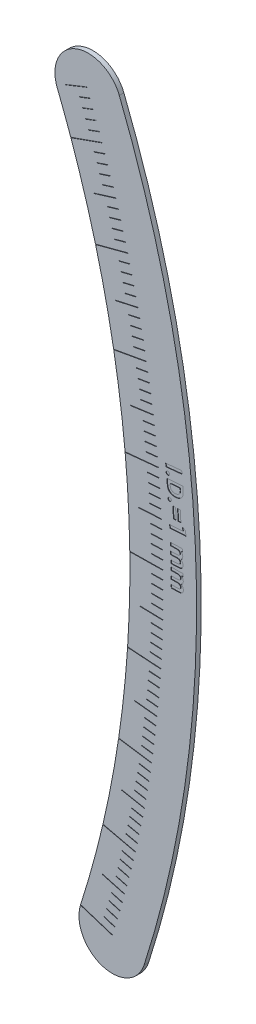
from build123d import *

# Parameters (mm, degrees)
EXTRUSION1_DEPTH             = 1
ENL_V_MAT_EXTRU_1_DEPTH      = 0.1
R_P_TITION_CIRCULAIRE1_COUNT = 86
R_P_TITION_CIRCULAIRE1_ANGLE = 39.5845
ENL_V_MAT_EXTRU_2_DEPTH      = 0.1
R_P_TITION_CIRCULAIRE2_COUNT = 9
R_P_TITION_CIRCULAIRE2_ANGLE = 37.256
ENL_V_MAT_EXTRU_3_DEPTH      = 0.1
R_P_TITION_CIRCULAIRE3_COUNT = 20
R_P_TITION_CIRCULAIRE3_ANGLE = 88.483
ENL_V_MAT_EXTRU_4_DEPTH      = 0.1


with BuildPart() as part:
    # Esquisse1 → Extrusion1 (new body)
    with BuildSketch(Plane.XY):
        with BuildLine():
            ThreePointArc((227.58368932, -72.98400068), (238.866520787, 7.986566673), (222.20038835, 88.022652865))
            ThreePointArc((222.20038835, 88.022652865), (212.789856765, 92.092897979), (208.71961165, 82.682366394))
            ThreePointArc((208.71961165, 82.682366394), (224.374618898, 7.502026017), (213.77631068, -68.556101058))
            ThreePointArc((213.77631068, -68.556101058), (218.466050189, -77.673740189), (227.58368932, -72.98400068))
        make_face()
    extrude(amount=EXTRUSION1_DEPTH)

    # Esquisse2 → Enl_v. mat.-Extru.1 (cut)
    with BuildSketch(Plane.XY.offset(1)):
        Polygon((220.695268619, -70.722439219), (220.664731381, -70.817662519), (218.284148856, -70.05423155), (218.314686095, -69.959008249), align=None)
    enl_v_mat_extru_1 = extrude(amount=-ENL_V_MAT_EXTRU_1_DEPTH, mode=Mode.SUBTRACT)

    # R_p_tition circulaire1: Enl_v. mat.-Extru.1 ×86 about axis
    r_p_tition_circulaire1_axis = Axis((0, 0, 0), (0, 0, 1))
    for i in range(1, R_P_TITION_CIRCULAIRE1_COUNT):
        add(enl_v_mat_extru_1.rotate(r_p_tition_circulaire1_axis, i * R_P_TITION_CIRCULAIRE1_ANGLE / (R_P_TITION_CIRCULAIRE1_COUNT - 1)), mode=Mode.SUBTRACT)

    # Esquisse3 → Enl_v. mat.-Extru.2 (cut)
    with BuildSketch(Plane.XY.offset(1)):
        Polygon((201.650608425, -64.614991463), (201.620071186, -64.710214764), (220.664731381, -70.817662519), (220.695268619, -70.722439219), align=None)
    enl_v_mat_extru_2 = extrude(amount=-ENL_V_MAT_EXTRU_2_DEPTH, mode=Mode.SUBTRACT)

    # R_p_tition circulaire2: Enl_v. mat.-Extru.2 ×9 about axis
    r_p_tition_circulaire2_axis = Axis((0, 0, 1), (0, 0, 1))
    for i in range(1, R_P_TITION_CIRCULAIRE2_COUNT):
        add(enl_v_mat_extru_2.rotate(r_p_tition_circulaire2_axis, i * R_P_TITION_CIRCULAIRE2_ANGLE / (R_P_TITION_CIRCULAIRE2_COUNT - 1)), mode=Mode.SUBTRACT)

    # Esquisse4 → Enl_v. mat.-Extru.3 (cut)
    with BuildSketch(Plane.XY.offset(1)):
        Polygon((218.567142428, -60.365298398), (218.540499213, -60.461683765), (223.359767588, -61.793844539), (223.386410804, -61.697459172), align=None)
    enl_v_mat_extru_3 = extrude(amount=-ENL_V_MAT_EXTRU_3_DEPTH, mode=Mode.SUBTRACT)

    # R_p_tition circulaire3: Enl_v. mat.-Extru.3 ×20 about axis
    r_p_tition_circulaire3_axis = Axis((0, 0, 0), (0, 0, 1))
    for i in range(1, R_P_TITION_CIRCULAIRE3_COUNT):
        add(enl_v_mat_extru_3.rotate(r_p_tition_circulaire3_axis, i * R_P_TITION_CIRCULAIRE3_ANGLE / (R_P_TITION_CIRCULAIRE3_COUNT - 1)), mode=Mode.SUBTRACT)

    # Esquisse5 → Enl_v. mat.-Extru.4 (cut)
    # profile 1 of 9: a face of its own
    with BuildSketch(Plane.XY.offset(1)):
        with BuildLine():
            Line((236.020542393, 4.922061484), (236.028254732, 4.273523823))
            Line((236.028254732, 4.273523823), (235.732381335, 4.270018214))
            add(Edge.make_bspline(
                [(235.732381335, 4.270018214), (235.761683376, 4.242518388), (235.819172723, 4.188564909), (235.894776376, 4.099371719), (235.958794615, 4.00540262), (236.011160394, 3.906361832), (236.051945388, 3.802856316), (236.081566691, 3.694523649), (236.100154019, 3.581443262), (236.103156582, 3.504229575), (236.104677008, 3.465130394)],
                knots=[0, 0, 0, 0, 1.053789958, 2.067490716, 3.060805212, 4.031893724, 5.000985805, 5.973950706, 6.974056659, 8, 8, 8, 8], degree=3))
            add(Edge.make_bspline(
                [(236.104677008, 3.465130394), (236.103558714, 3.425793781), (236.101359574, 3.34843785), (236.081154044, 3.235010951), (236.043572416, 3.128107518), (235.993339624, 3.026855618), (235.928681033, 2.932840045), (235.848589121, 2.848878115), (235.755930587, 2.77289676), (235.685577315, 2.732205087), (235.649648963, 2.711424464)],
                knots=[0, 0, 0, 0, 1.016603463, 1.999163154, 2.964175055, 3.937006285, 4.914200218, 5.901652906, 6.92840586, 8, 8, 8, 8], degree=3))
            add(Edge.make_bspline(
                [(235.649648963, 2.711424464), (235.686319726, 2.685646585), (235.758193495, 2.635122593), (235.853127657, 2.545449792), (235.934131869, 2.446801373), (236.001695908, 2.339855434), (236.055277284, 2.225877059), (236.093898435, 2.105726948), (236.118474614, 1.980198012), (236.12234889, 1.894494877), (236.124308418, 1.851148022)],
                knots=[0, 0, 0, 0, 1.049319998, 2.05664071, 3.048856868, 4.03341101, 5.013385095, 5.99190436, 6.984347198, 8, 8, 8, 8], degree=3))
            add(Edge.make_bspline(
                [(236.124308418, 1.851148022), (236.123431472, 1.806643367), (236.121720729, 1.719823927), (236.098563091, 1.593553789), (236.059929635, 1.475233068), (236.005479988, 1.366090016), (235.937303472, 1.269075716), (235.859932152, 1.183927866), (235.771078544, 1.114772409), (235.688660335, 1.068361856), (235.614832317, 1.040034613), (235.551553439, 1.020006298), (235.479802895, 1.004793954), (235.400203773, 0.99012758), (235.312287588, 0.980568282), (235.216487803, 0.971806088), (235.112646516, 0.966330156), (235.0406137, 0.964947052), (235.003214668, 0.964228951)],
                knots=[0, 0, 0, 0, 1.300204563, 2.536432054, 3.738278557, 4.930483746, 6.08909893, 7.196811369, 8.282540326, 9.368721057, 9.948814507, 10.593096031, 11.307824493, 12.092242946, 12.959599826, 13.892842, 14.905975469, 16, 16, 16, 16], degree=3))
            Line((235.003214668, 0.964228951), (233.493699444, 0.945999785))
            Line((233.493699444, 0.945999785), (233.485987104, 1.59664081))
            Line((233.485987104, 1.59664081), (234.792177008, 1.612766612))
            add(Edge.make_bspline(
                [(234.792177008, 1.612766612), (234.827246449, 1.61338751), (234.894403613, 1.614576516), (234.990489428, 1.621233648), (235.077904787, 1.629617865), (235.156262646, 1.643096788), (235.225859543, 1.659005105), (235.286993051, 1.677464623), (235.338966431, 1.700474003), (235.382961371, 1.726959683), (235.420085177, 1.756649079), (235.450896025, 1.790290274), (235.478290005, 1.825880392), (235.499025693, 1.866019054), (235.516436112, 1.908780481), (235.526960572, 1.955685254), (235.53462701, 2.00537384), (235.534652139, 2.039717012), (235.534664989, 2.05727783)],
                knots=[0, 0, 0, 0, 1.704766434, 3.264588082, 4.681081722, 5.971701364, 7.126402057, 8.150475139, 9.071002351, 9.881549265, 10.640958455, 11.372403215, 12.09497089, 12.816734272, 13.561469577, 14.333019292, 15.147616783, 16, 16, 16, 16], degree=3))
            add(Edge.make_bspline(
                [(235.534664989, 2.05727783), (235.533149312, 2.084251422), (235.530175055, 2.137182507), (235.511599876, 2.214396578), (235.480012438, 2.286460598), (235.437977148, 2.354021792), (235.385253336, 2.414758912), (235.323652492, 2.468484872), (235.251854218, 2.511617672), (235.185567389, 2.540981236), (235.126432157, 2.560384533), (235.074928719, 2.573121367), (235.016900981, 2.582166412), (234.952901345, 2.590917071), (234.8827054, 2.596926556), (234.806023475, 2.601352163), (234.723000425, 2.602244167), (234.665506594, 2.602115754), (234.635826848, 2.602049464)],
                knots=[0, 0, 0, 0, 1.088542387, 2.136079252, 3.183616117, 4.251165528, 5.33434389, 6.417522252, 7.535086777, 8.700331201, 9.335510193, 10.044518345, 10.838264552, 11.70382358, 12.650635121, 13.680061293, 14.802389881, 16, 16, 16, 16], degree=3))
            Line((234.635826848, 2.602049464), (233.474068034, 2.588027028))
            Line((233.474068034, 2.588027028), (233.465654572, 3.238668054))
            Line((233.465654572, 3.238668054), (234.712950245, 3.254092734))
            add(Edge.make_bspline(
                [(234.712950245, 3.254092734), (234.740761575, 3.254763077), (234.794289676, 3.256053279), (234.871701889, 3.258413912), (234.943000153, 3.26343639), (235.008448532, 3.269783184), (235.067987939, 3.276940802), (235.121360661, 3.287329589), (235.169180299, 3.2970335), (235.223338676, 3.313966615), (235.283273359, 3.33790841), (235.346441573, 3.37377817), (235.400052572, 3.415864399), (235.442597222, 3.465311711), (235.476278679, 3.519833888), (235.499199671, 3.580036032), (235.513170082, 3.64513821), (235.513936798, 3.690116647), (235.514332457, 3.713327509)],
                knots=[0, 0, 0, 0, 1.27494814, 2.45387599, 3.548911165, 4.549636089, 5.467615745, 6.295305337, 7.041124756, 7.701795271, 8.893160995, 9.991804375, 11.020509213, 11.999856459, 12.966055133, 13.94264588, 14.938314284, 16, 16, 16, 16], degree=3))
            add(Edge.make_bspline(
                [(235.514332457, 3.713327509), (235.512771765, 3.739592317), (235.509682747, 3.791577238), (235.491401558, 3.867813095), (235.458921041, 3.939081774), (235.415962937, 4.005940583), (235.362744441, 4.067097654), (235.298964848, 4.120339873), (235.224837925, 4.163501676), (235.156662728, 4.193546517), (235.095564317, 4.21294549), (235.042809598, 4.22536646), (234.984035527, 4.235690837), (234.919000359, 4.244104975), (234.8478843, 4.250211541), (234.770488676, 4.254352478), (234.687020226, 4.256457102), (234.629283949, 4.256153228), (234.599368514, 4.255995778)],
                knots=[0, 0, 0, 0, 1.051194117, 2.080587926, 3.114260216, 4.169685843, 5.249626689, 6.344835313, 7.476734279, 8.669901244, 9.317380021, 10.038425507, 10.836119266, 11.703464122, 12.660713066, 13.69057371, 14.803395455, 16, 16, 16, 16], degree=3))
            Line((234.599368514, 4.255995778), (233.453735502, 4.241973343))
            Line((233.453735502, 4.241973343), (233.446023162, 4.890511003))
            Line((233.446023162, 4.890511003), (236.020542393, 4.922061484))
        make_face()
    # profile 2 of 9: a face of its own
    with BuildSketch(Plane.XY.offset(1)):
        with BuildLine():
            Line((235.879117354, 9.546981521), (235.900151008, 8.898443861))
            Line((235.900151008, 8.898443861), (235.60427761, 8.889329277))
            add(Edge.make_bspline(
                [(235.60427761, 8.889329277), (235.633967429, 8.862246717), (235.69228669, 8.809048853), (235.77025343, 8.722043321), (235.834801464, 8.628432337), (235.889359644, 8.530733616), (235.932263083, 8.427889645), (235.963761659, 8.320186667), (235.985671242, 8.207741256), (235.989869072, 8.130582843), (235.991997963, 8.091452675)],
                knots=[0, 0, 0, 0, 1.054184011, 2.07071772, 3.057438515, 4.03192478, 5.00229213, 5.974440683, 6.972756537, 8, 8, 8, 8], degree=3))
            add(Edge.make_bspline(
                [(235.991997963, 8.091452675), (235.991975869, 8.052109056), (235.991932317, 7.974551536), (235.972034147, 7.860855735), (235.938564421, 7.752308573), (235.888833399, 7.650365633), (235.825928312, 7.555307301), (235.747986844, 7.469387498), (235.656494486, 7.392333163), (235.587133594, 7.350173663), (235.551693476, 7.328632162)],
                knots=[0, 0, 0, 0, 1.015025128, 2.000904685, 2.969297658, 3.941674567, 4.921524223, 5.90503334, 6.929571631, 8, 8, 8, 8], degree=3))
            add(Edge.make_bspline(
                [(235.551693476, 7.328632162), (235.58881253, 7.303564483), (235.661756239, 7.254303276), (235.758553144, 7.166260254), (235.841662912, 7.069027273), (235.911564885, 6.963374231), (235.966951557, 6.850397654), (236.007757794, 6.731204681), (236.035515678, 6.606523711), (236.04060359, 6.520850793), (236.043179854, 6.477470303)],
                knots=[0, 0, 0, 0, 1.048141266, 2.059732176, 3.053735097, 4.037631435, 5.019408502, 5.992385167, 6.983444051, 8, 8, 8, 8], degree=3))
            add(Edge.make_bspline(
                [(236.043179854, 6.477470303), (236.042905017, 6.432999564), (236.042368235, 6.346144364), (236.022564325, 6.21926674), (235.985839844, 6.100291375), (235.93331716, 5.990375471), (235.867495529, 5.891819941), (235.791488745, 5.805514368), (235.70386589, 5.734597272), (235.622166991, 5.687061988), (235.549187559, 5.65606672), (235.485836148, 5.636428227), (235.414890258, 5.617653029), (235.335215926, 5.603989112), (235.247960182, 5.589941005), (235.152151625, 5.580945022), (235.048396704, 5.572815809), (234.97632205, 5.570182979), (234.938913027, 5.568816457)],
                knots=[0, 0, 0, 0, 1.299234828, 2.537518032, 3.73948777, 4.928681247, 6.086890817, 7.19539355, 8.27883443, 9.369044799, 9.947897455, 10.594162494, 11.306969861, 12.092511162, 12.956657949, 13.891085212, 14.905406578, 16, 16, 16, 16], degree=3))
            Line((234.938913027, 5.568816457), (233.429397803, 5.521140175))
            Line((233.429397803, 5.521140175), (233.409065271, 6.171781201))
            Line((233.409065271, 6.171781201), (234.715255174, 6.213147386))
            add(Edge.make_bspline(
                [(234.715255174, 6.213147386), (234.750331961, 6.214457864), (234.817533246, 6.21696852), (234.913613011, 6.225711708), (235.000799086, 6.23623312), (235.078761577, 6.251528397), (235.14858998, 6.26726426), (235.208979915, 6.288542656), (235.260741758, 6.311973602), (235.3040392, 6.339258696), (235.340163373, 6.36968577), (235.370739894, 6.403350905), (235.397161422, 6.439679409), (235.41723497, 6.480462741), (235.433728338, 6.523754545), (235.443963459, 6.570760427), (235.44972402, 6.620582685), (235.449463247, 6.654838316), (235.449329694, 6.672382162)],
                knots=[0, 0, 0, 0, 1.70562887, 3.26770108, 4.687831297, 5.970989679, 7.128052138, 8.162611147, 9.077305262, 9.883998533, 10.641704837, 11.365268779, 12.09016878, 12.816580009, 13.56770227, 14.336480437, 15.148036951, 16, 16, 16, 16], degree=3))
            add(Edge.make_bspline(
                [(235.449329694, 6.672382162), (235.447340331, 6.699367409), (235.443431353, 6.7523918), (235.423559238, 6.829440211), (235.390360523, 6.900933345), (235.347150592, 6.967749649), (235.292790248, 7.027156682), (235.229874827, 7.079280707), (235.157271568, 7.12100046), (235.090570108, 7.149806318), (235.030605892, 7.166709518), (234.979066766, 7.179129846), (234.921075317, 7.187592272), (234.856773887, 7.194655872), (234.786374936, 7.199638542), (234.709422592, 7.201121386), (234.62643374, 7.202389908), (234.568952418, 7.200566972), (234.539273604, 7.199625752)],
                knots=[0, 0, 0, 0, 1.089507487, 2.140816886, 3.18657978, 4.25551936, 5.336230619, 6.420878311, 7.535960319, 8.701498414, 9.339611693, 10.045883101, 10.837511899, 11.700150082, 12.654137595, 13.681613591, 14.802968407, 16, 16, 16, 16], degree=3))
            Line((234.539273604, 7.199625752), (233.37751479, 7.163167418))
            Line((233.37751479, 7.163167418), (233.357182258, 7.813808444))
            Line((233.357182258, 7.813808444), (234.604477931, 7.853071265))
            add(Edge.make_bspline(
                [(234.604477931, 7.853071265), (234.632295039, 7.854113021), (234.685854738, 7.856118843), (234.763233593, 7.861059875), (234.8345439, 7.867274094), (234.899815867, 7.874780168), (234.958885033, 7.884201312), (235.012416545, 7.893466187), (235.059928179, 7.905351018), (235.114072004, 7.922718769), (235.173454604, 7.948208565), (235.236013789, 7.985115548), (235.28791458, 8.029199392), (235.330180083, 8.07880048), (235.36182413, 8.134401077), (235.384844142, 8.194568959), (235.396635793, 8.26018839), (235.397171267, 8.305253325), (235.397446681, 8.328431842)],
                knots=[0, 0, 0, 0, 1.275234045, 2.455364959, 3.551702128, 4.554376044, 5.464454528, 6.291862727, 7.04233267, 7.705981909, 8.895353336, 9.995239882, 11.020692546, 12.00087707, 12.965024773, 13.937459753, 14.939161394, 16, 16, 16, 16], degree=3))
            add(Edge.make_bspline(
                [(235.397446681, 8.328431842), (235.395611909, 8.354767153), (235.391982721, 8.406858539), (235.369494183, 8.48208217), (235.337529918, 8.553637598), (235.292772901, 8.61962212), (235.238110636, 8.679328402), (235.173349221, 8.731139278), (235.099123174, 8.774050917), (235.029748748, 8.80173546), (234.968436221, 8.820429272), (234.915267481, 8.831025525), (234.85645284, 8.841273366), (234.791074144, 8.847794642), (234.719760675, 8.852631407), (234.642363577, 8.855598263), (234.558896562, 8.855123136), (234.501177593, 8.854101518), (234.47126479, 8.853572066)],
                knots=[0, 0, 0, 0, 1.052457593, 2.081766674, 3.118723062, 4.176022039, 5.253927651, 6.343954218, 7.478560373, 8.668816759, 9.322124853, 10.038653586, 10.834330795, 11.708282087, 12.663557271, 13.692017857, 14.803890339, 16, 16, 16, 16], degree=3))
            Line((234.47126479, 8.853572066), (233.325631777, 8.817113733))
            Line((233.325631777, 8.817113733), (233.304598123, 9.465651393))
            Line((233.304598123, 9.465651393), (235.879117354, 9.546981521))
        make_face()
    # profile 3 of 9: a face of its own
    with BuildSketch(Plane.XY.offset(1)):
        Polygon((236.61255119, 13.256082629), (236.665836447, 12.263995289), (233.184766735, 12.075393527), (233.149009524, 12.733746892), (236.007483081, 12.888694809), (235.968921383, 13.605241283), align=None)
    # profile 4 of 9: a face of its own
    with BuildSketch(Plane.XY.offset(1)):
        Polygon((235.452921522, 16.640635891), (235.581226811, 14.276453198), (234.989480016, 14.244902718), (234.861174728, 16.60908541), align=None)
    # profile 5 of 9: a face of its own
    with BuildSketch(Plane.XY.offset(1)):
        Polygon((234.439800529, 16.585948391), (234.568105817, 14.221765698), (233.977060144, 14.189514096), (233.848754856, 16.553696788), align=None)
    # profile 6 of 9: a face of its own
    with BuildSketch(Plane.XY.offset(1)):
        with BuildLine():
            add(Edge.make_bspline(
                [(233.521690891, 17.488999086), (233.5221747, 17.464171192), (233.523124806, 17.41541412), (233.5081414, 17.343706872), (233.477540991, 17.277367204), (233.435095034, 17.217230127), (233.383091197, 17.164771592), (233.321495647, 17.126097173), (233.253620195, 17.098483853), (233.205046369, 17.092907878), (233.180244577, 17.090060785)],
                knots=[0, 0, 0, 0, 1.019091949, 2.001294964, 2.982180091, 4.003536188, 5.01630721, 5.997569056, 6.977558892, 8, 8, 8, 8], degree=3))
            add(Edge.make_bspline(
                [(233.180244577, 17.090060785), (233.155415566, 17.089574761), (233.1066563, 17.088620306), (233.034965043, 17.103635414), (232.96844088, 17.134171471), (232.908176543, 17.1773953), (232.856427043, 17.230687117), (232.817282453, 17.292305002), (232.789745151, 17.360249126), (232.784158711, 17.408813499), (232.781306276, 17.433610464)],
                knots=[0, 0, 0, 0, 1.016636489, 1.996472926, 2.974994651, 3.999425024, 5.023496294, 6.002393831, 6.980022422, 8, 8, 8, 8], degree=3))
            add(Edge.make_bspline(
                [(232.781306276, 17.433610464), (232.780806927, 17.458672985), (232.779830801, 17.507665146), (232.794867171, 17.579602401), (232.825322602, 17.645774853), (232.868068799, 17.706027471), (232.921493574, 17.757232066), (232.982450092, 17.797626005), (233.051055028, 17.823700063), (233.099405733, 17.830016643), (233.124154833, 17.833249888)],
                knots=[0, 0, 0, 0, 1.026281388, 2.006172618, 2.984749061, 3.995864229, 5.019992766, 6.004144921, 6.978388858, 8, 8, 8, 8], degree=3))
            add(Edge.make_bspline(
                [(233.124154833, 17.833249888), (233.149242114, 17.833856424), (233.198103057, 17.835037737), (233.269518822, 17.818592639), (233.335879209, 17.788713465), (233.395344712, 17.745165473), (233.446686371, 17.692352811), (233.486118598, 17.630999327), (233.512063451, 17.562314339), (233.518441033, 17.513747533), (233.521690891, 17.488999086)],
                knots=[0, 0, 0, 0, 1.027765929, 2.001716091, 2.981708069, 3.999872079, 5.0119032, 5.992271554, 6.976911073, 8, 8, 8, 8], degree=3))
        make_face()
    # profile 7 of 9: a face of its own
    with BuildSketch(Plane.XY.offset(1)):
        with BuildLine():
            Line((236.017785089, 21.378064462), (236.07667932, 20.59210693))
            add(Edge.make_bspline(
                [(236.07667932, 20.59210693), (236.080891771, 20.530899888), (236.089053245, 20.412313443), (236.093162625, 20.239924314), (236.090770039, 20.079199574), (236.080965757, 19.93039125), (236.065279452, 19.793138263), (236.042527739, 19.667459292), (236.012469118, 19.553538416), (235.975903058, 19.449830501), (235.930389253, 19.354796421), (235.879450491, 19.263559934), (235.819273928, 19.176928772), (235.752694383, 19.092693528), (235.676968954, 19.013249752), (235.595237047, 18.9353811), (235.504204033, 18.863087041), (235.407344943, 18.793476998), (235.303594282, 18.73013162), (235.194915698, 18.672016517), (235.080420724, 18.622745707), (234.961332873, 18.579630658), (234.837240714, 18.543760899), (234.707777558, 18.516347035), (234.573822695, 18.493773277), (234.482404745, 18.485782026), (234.43605432, 18.481730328)],
                knots=[0, 0, 0, 0, 1.440319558, 2.790567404, 4.047323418, 5.213139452, 6.290556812, 7.289314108, 8.209018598, 9.054275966, 9.866767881, 10.680093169, 11.505015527, 12.340545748, 13.198460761, 14.079644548, 14.988878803, 15.925275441, 16.878608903, 17.840807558, 18.816384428, 19.802276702, 20.813020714, 21.846243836, 22.908009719, 24, 24, 24, 24], degree=3))
            add(Edge.make_bspline(
                [(234.43605432, 18.481730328), (234.370159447, 18.47842352), (234.240642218, 18.471923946), (234.048813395, 18.482944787), (233.863916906, 18.51051458), (233.687237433, 18.556375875), (233.520597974, 18.616873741), (233.366001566, 18.692028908), (233.224906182, 18.781462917), (233.098315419, 18.883755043), (232.986606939, 18.995694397), (232.891956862, 19.115476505), (232.811766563, 19.240140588), (232.759959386, 19.352330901), (232.725281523, 19.450491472), (232.701856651, 19.537033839), (232.680391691, 19.636329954), (232.660359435, 19.748155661), (232.641464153, 19.872768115), (232.624002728, 20.009973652), (232.608616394, 20.160061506), (232.600518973, 20.264429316), (232.59631073, 20.31866943)],
                knots=[0, 0, 0, 0, 1.319585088, 2.593661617, 3.837857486, 5.055036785, 6.24020148, 7.380180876, 8.488234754, 9.575845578, 10.630827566, 11.646124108, 12.625762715, 13.590381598, 14.111064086, 14.707908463, 15.383115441, 16.143627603, 16.981032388, 17.905150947, 18.911303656, 20, 20, 20, 20], degree=3))
            Line((232.59631073, 20.31866943), (232.536715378, 21.116546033))
            Line((232.536715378, 21.116546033), (236.017785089, 21.378064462))
        make_face()
        with BuildLine():
            Line((235.42814166, 20.66993145), (233.235032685, 20.505167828))
            Line((233.235032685, 20.505167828), (233.258169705, 20.19737536))
            add(Edge.make_bspline(
                [(233.258169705, 20.19737536), (233.261156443, 20.160887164), (233.266929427, 20.090360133), (233.279887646, 19.988948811), (233.293918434, 19.895182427), (233.312579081, 19.809729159), (233.332267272, 19.731776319), (233.355572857, 19.662332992), (233.380381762, 19.600449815), (233.418987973, 19.529311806), (233.477757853, 19.449801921), (233.565140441, 19.367023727), (233.668468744, 19.294334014), (233.767001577, 19.244688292), (233.852690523, 19.210466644), (233.92207824, 19.189813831), (233.994010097, 19.171914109), (234.069536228, 19.159564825), (234.148183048, 19.151211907), (234.230105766, 19.146867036), (234.315287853, 19.147926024), (234.372963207, 19.151089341), (234.402400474, 19.152703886)],
                knots=[0, 0, 0, 0, 1.223386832, 2.364650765, 3.416361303, 4.390682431, 5.286786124, 6.101886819, 6.837308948, 7.511804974, 8.802200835, 10.122508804, 11.518114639, 13.009738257, 13.798786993, 14.599311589, 15.427186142, 16.274688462, 17.154508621, 18.069576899, 19.014719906, 20, 20, 20, 20], degree=3))
            add(Edge.make_bspline(
                [(234.402400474, 19.152703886), (234.447149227, 19.156807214), (234.53460207, 19.164826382), (234.660603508, 19.190027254), (234.778761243, 19.222307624), (234.887704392, 19.265541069), (234.988798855, 19.316607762), (235.081097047, 19.377115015), (235.165003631, 19.44695604), (235.21371405, 19.500337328), (235.238137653, 19.527102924)],
                knots=[0, 0, 0, 0, 1.145657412, 2.238967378, 3.273349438, 4.266493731, 5.223768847, 6.158097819, 7.076462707, 8, 8, 8, 8], degree=3))
            add(Edge.make_bspline(
                [(235.238137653, 19.527102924), (235.258559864, 19.553213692), (235.300022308, 19.606225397), (235.348670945, 19.697721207), (235.388665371, 19.798101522), (235.418615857, 19.908721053), (235.439355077, 20.028905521), (235.450824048, 20.159017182), (235.453928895, 20.298905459), (235.448023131, 20.395111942), (235.444968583, 20.444871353)],
                knots=[0, 0, 0, 0, 0.823931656, 1.672797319, 2.568508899, 3.510048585, 4.520210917, 5.601171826, 6.759290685, 8, 8, 8, 8], degree=3))
            Line((235.444968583, 20.444871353), (235.42814166, 20.66993145))
        make_face(mode=Mode.SUBTRACT)
    # profile 8 of 9: a face of its own
    with BuildSketch(Plane.XY.offset(1)):
        with BuildLine():
            add(Edge.make_bspline(
                [(233.118365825, 22.241844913), (233.119697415, 22.21701337), (233.122322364, 22.168063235), (233.107193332, 22.096289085), (233.079398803, 22.028419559), (233.037366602, 21.967362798), (232.98623867, 21.913873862), (232.925933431, 21.872804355), (232.857887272, 21.845438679), (232.809403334, 21.838194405), (232.784631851, 21.83449315)],
                knots=[0, 0, 0, 0, 1.015776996, 2.002389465, 2.977581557, 4.006114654, 5.022569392, 5.995310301, 6.97576105, 8, 8, 8, 8], degree=3))
            add(Edge.make_bspline(
                [(232.784631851, 21.83449315), (232.7598216, 21.833554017), (232.710956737, 21.831704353), (232.638827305, 21.845226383), (232.571504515, 21.874247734), (232.510563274, 21.916364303), (232.457044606, 21.968124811), (232.416859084, 22.029351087), (232.388734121, 22.097214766), (232.381628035, 22.145533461), (232.37798121, 22.17033049)],
                knots=[0, 0, 0, 0, 1.014761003, 1.998615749, 2.976584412, 3.996210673, 5.018395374, 6.006108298, 6.976739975, 8, 8, 8, 8], degree=3))
            add(Edge.make_bspline(
                [(232.37798121, 22.17033049), (232.377029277, 22.195374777), (232.375163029, 22.244473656), (232.388709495, 22.316838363), (232.417741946, 22.384151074), (232.45983193, 22.445130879), (232.511550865, 22.498365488), (232.572236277, 22.539004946), (232.640023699, 22.566896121), (232.688327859, 22.574024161), (232.713117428, 22.577682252)],
                knots=[0, 0, 0, 0, 1.024128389, 2.007785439, 2.985557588, 4.004978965, 5.026958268, 6.006508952, 6.97694559, 8, 8, 8, 8], degree=3))
            add(Edge.make_bspline(
                [(232.713117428, 22.577682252), (232.738166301, 22.578657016), (232.787044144, 22.580559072), (232.859119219, 22.566809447), (232.926108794, 22.538095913), (232.986579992, 22.495814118), (233.039026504, 22.443879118), (233.079908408, 22.383297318), (233.107439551, 22.315108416), (233.114671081, 22.266619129), (233.118365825, 22.241844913)],
                knots=[0, 0, 0, 0, 1.026079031, 2.00218703, 2.981821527, 3.995275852, 5.012398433, 5.993814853, 6.974996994, 8, 8, 8, 8], degree=3))
        make_face()
    # profile 9 of 9: a face of its own
    with BuildSketch(Plane.XY.offset(1)):
        Polygon((235.757823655, 24.179460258), (235.820924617, 23.521808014), (232.339854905, 23.186671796), (232.276753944, 23.84432404), align=None)
    extrude(amount=-ENL_V_MAT_EXTRU_4_DEPTH, mode=Mode.SUBTRACT)


solid = part.part
